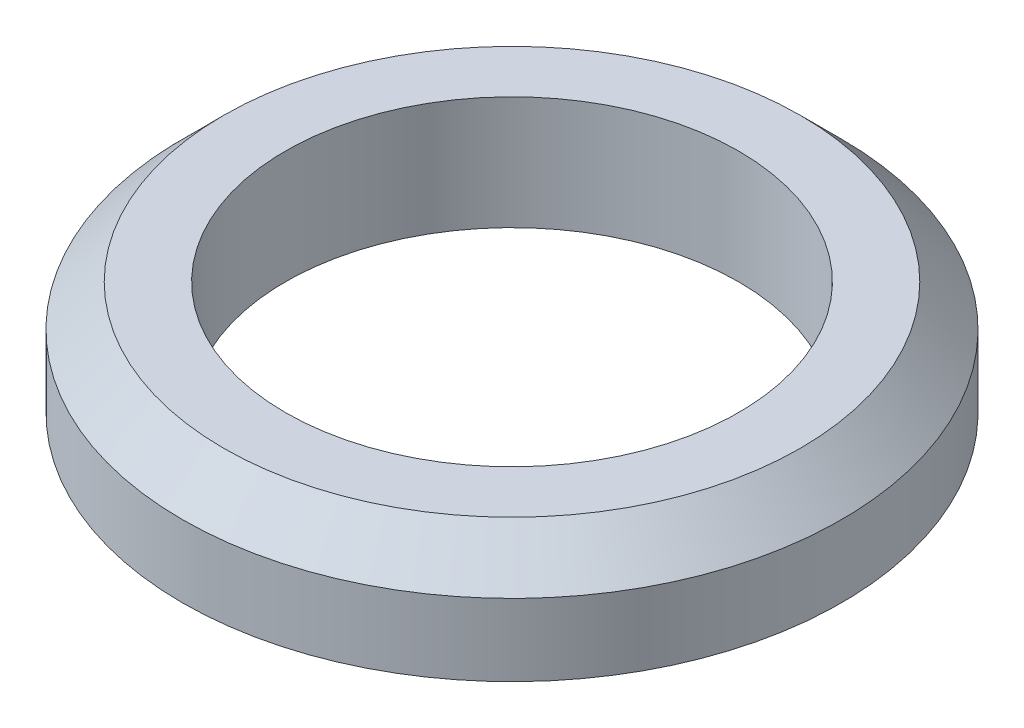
ISO-10303-21;
HEADER;
FILE_DESCRIPTION(('STEP AP214'),'2;1');
FILE_NAME('part.step','',(''),(''),'','','');
FILE_SCHEMA(('AUTOMOTIVE_DESIGN { 1 0 10303 214 1 1 1 1 }'));
ENDSEC;
DATA;
#1=APPLICATION_CONTEXT('core data for automotive mechanical design processes');
#2=APPLICATION_PROTOCOL_DEFINITION('international standard','automotive_design',2000,#1);
#3=PRODUCT_CONTEXT('',#1,'mechanical');
#4=PRODUCT('Part','Part','',(#3));
#5=PRODUCT_RELATED_PRODUCT_CATEGORY('part','',(#4));
#6=PRODUCT_DEFINITION_FORMATION('','',#4);
#7=PRODUCT_DEFINITION_CONTEXT('part definition',#1,'design');
#8=PRODUCT_DEFINITION('design','',#6,#7);
#9=PRODUCT_DEFINITION_SHAPE('','',#8);
#10=(LENGTH_UNIT() NAMED_UNIT(*) SI_UNIT(.MILLI.,.METRE.));
#11=(NAMED_UNIT(*) PLANE_ANGLE_UNIT() SI_UNIT($,.RADIAN.));
#12=(NAMED_UNIT(*) SI_UNIT($,.STERADIAN.) SOLID_ANGLE_UNIT());
#13=UNCERTAINTY_MEASURE_WITH_UNIT(LENGTH_MEASURE(1.E-05),#10,'distance_accuracy_value','');
#14=(GEOMETRIC_REPRESENTATION_CONTEXT(3) GLOBAL_UNCERTAINTY_ASSIGNED_CONTEXT((#13)) GLOBAL_UNIT_ASSIGNED_CONTEXT((#10,
#11,#12)) REPRESENTATION_CONTEXT('',''));
#15=CARTESIAN_POINT('',(0.,0.,0.));
#16=DIRECTION('',(0.,0.,1.));
#17=DIRECTION('',(1.,0.,0.));
#18=AXIS2_PLACEMENT_3D('',#15,#16,#17);
#19=CARTESIAN_POINT('',(0.,1.375,0.));
#20=DIRECTION('',(0.,1.,0.));
#21=DIRECTION('',(0.,0.,1.));
#22=AXIS2_PLACEMENT_3D('',#19,#20,#21);
#23=PLANE('',#22);
#24=CARTESIAN_POINT('',(0.,1.375,0.));
#25=DIRECTION('',(0.,1.,0.));
#26=DIRECTION('',(0.,0.,1.));
#27=AXIS2_PLACEMENT_3D('',#24,#25,#26);
#28=CIRCLE('',#27,6.99999999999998);
#29=CARTESIAN_POINT('',(0.,1.375,6.99999999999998));
#30=VERTEX_POINT('',#29);
#31=EDGE_CURVE('E33',#30,#30,#28,.T.);
#32=ORIENTED_EDGE('',*,*,#31,.T.);
#33=EDGE_LOOP('',(#32));
#34=FACE_BOUND('',#33,.T.);
#35=CARTESIAN_POINT('',(0.,1.375,0.));
#36=DIRECTION('',(0.,1.,0.));
#37=DIRECTION('',(0.,0.,1.));
#38=AXIS2_PLACEMENT_3D('',#35,#36,#37);
#39=CIRCLE('',#38,5.5);
#40=CARTESIAN_POINT('',(0.,1.375,5.5));
#41=VERTEX_POINT('',#40);
#42=EDGE_CURVE('E41',#41,#41,#39,.T.);
#43=ORIENTED_EDGE('',*,*,#42,.F.);
#44=EDGE_LOOP('',(#43));
#45=FACE_BOUND('',#44,.T.);
#46=ADVANCED_FACE('F26',(#34,#45),#23,.T.);
#47=CARTESIAN_POINT('',(0.,-1.375,0.));
#48=DIRECTION('',(0.,1.,0.));
#49=DIRECTION('',(0.,0.,1.));
#50=AXIS2_PLACEMENT_3D('',#47,#48,#49);
#51=PLANE('',#50);
#52=CARTESIAN_POINT('',(0.,-1.375,0.));
#53=DIRECTION('',(0.,1.,0.));
#54=DIRECTION('',(0.,0.,1.));
#55=AXIS2_PLACEMENT_3D('',#52,#53,#54);
#56=CIRCLE('',#55,8.);
#57=CARTESIAN_POINT('',(0.,-1.375,8.));
#58=VERTEX_POINT('',#57);
#59=EDGE_CURVE('E37',#58,#58,#56,.T.);
#60=ORIENTED_EDGE('',*,*,#59,.F.);
#61=EDGE_LOOP('',(#60));
#62=FACE_BOUND('',#61,.T.);
#63=CARTESIAN_POINT('',(0.,-1.375,0.));
#64=DIRECTION('',(0.,1.,0.));
#65=DIRECTION('',(0.,0.,1.));
#66=AXIS2_PLACEMENT_3D('',#63,#64,#65);
#67=CIRCLE('',#66,5.5);
#68=CARTESIAN_POINT('',(0.,-1.375,5.5));
#69=VERTEX_POINT('',#68);
#70=EDGE_CURVE('E46',#69,#69,#67,.T.);
#71=ORIENTED_EDGE('',*,*,#70,.T.);
#72=EDGE_LOOP('',(#71));
#73=FACE_BOUND('',#72,.T.);
#74=ADVANCED_FACE('F50',(#62,#73),#51,.F.);
#75=CARTESIAN_POINT('',(0.,1.375,0.));
#76=DIRECTION('',(0.,-1.,0.));
#77=DIRECTION('',(0.,0.,-1.));
#78=AXIS2_PLACEMENT_3D('',#75,#76,#77);
#79=CYLINDRICAL_SURFACE('',#78,8.);
#80=CARTESIAN_POINT('',(0.,0.374999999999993,0.));
#81=DIRECTION('',(0.,1.,0.));
#82=DIRECTION('',(0.,0.,1.));
#83=AXIS2_PLACEMENT_3D('',#80,#81,#82);
#84=CIRCLE('',#83,8.);
#85=CARTESIAN_POINT('',(0.,0.374999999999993,8.));
#86=VERTEX_POINT('',#85);
#87=EDGE_CURVE('E10',#86,#86,#84,.F.);
#88=ORIENTED_EDGE('',*,*,#87,.T.);
#89=EDGE_LOOP('',(#88));
#90=FACE_BOUND('',#89,.T.);
#91=ORIENTED_EDGE('',*,*,#59,.T.);
#92=EDGE_LOOP('',(#91));
#93=FACE_BOUND('',#92,.T.);
#94=ADVANCED_FACE('F28',(#90,#93),#79,.T.);
#95=CARTESIAN_POINT('',(0.,1.375,0.));
#96=DIRECTION('',(0.,-1.,0.));
#97=DIRECTION('',(0.,0.,-1.));
#98=AXIS2_PLACEMENT_3D('',#95,#96,#97);
#99=CYLINDRICAL_SURFACE('',#98,5.5);
#100=ORIENTED_EDGE('',*,*,#42,.T.);
#101=EDGE_LOOP('',(#100));
#102=FACE_BOUND('',#101,.T.);
#103=ORIENTED_EDGE('',*,*,#70,.F.);
#104=EDGE_LOOP('',(#103));
#105=FACE_BOUND('',#104,.T.);
#106=ADVANCED_FACE('F52',(#102,#105),#99,.F.);
#107=CARTESIAN_POINT('',(0.,1.375,0.));
#108=DIRECTION('',(0.,-1.,0.));
#109=DIRECTION('',(0.,0.,-1.));
#110=AXIS2_PLACEMENT_3D('',#107,#108,#109);
#111=CONICAL_SURFACE('',#110,6.99999999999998,0.785398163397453);
#112=ORIENTED_EDGE('',*,*,#87,.F.);
#113=EDGE_LOOP('',(#112));
#114=FACE_BOUND('',#113,.T.);
#115=ORIENTED_EDGE('',*,*,#31,.F.);
#116=EDGE_LOOP('',(#115));
#117=FACE_BOUND('',#116,.T.);
#118=ADVANCED_FACE('F54',(#114,#117),#111,.T.);
#119=CLOSED_SHELL('',(#46,#74,#94,#106,#118));
#120=MANIFOLD_SOLID_BREP('B2',#119);
#121=ADVANCED_BREP_SHAPE_REPRESENTATION('',(#18,#120),#14);
#122=SHAPE_DEFINITION_REPRESENTATION(#9,#121);
ENDSEC;
END-ISO-10303-21;
